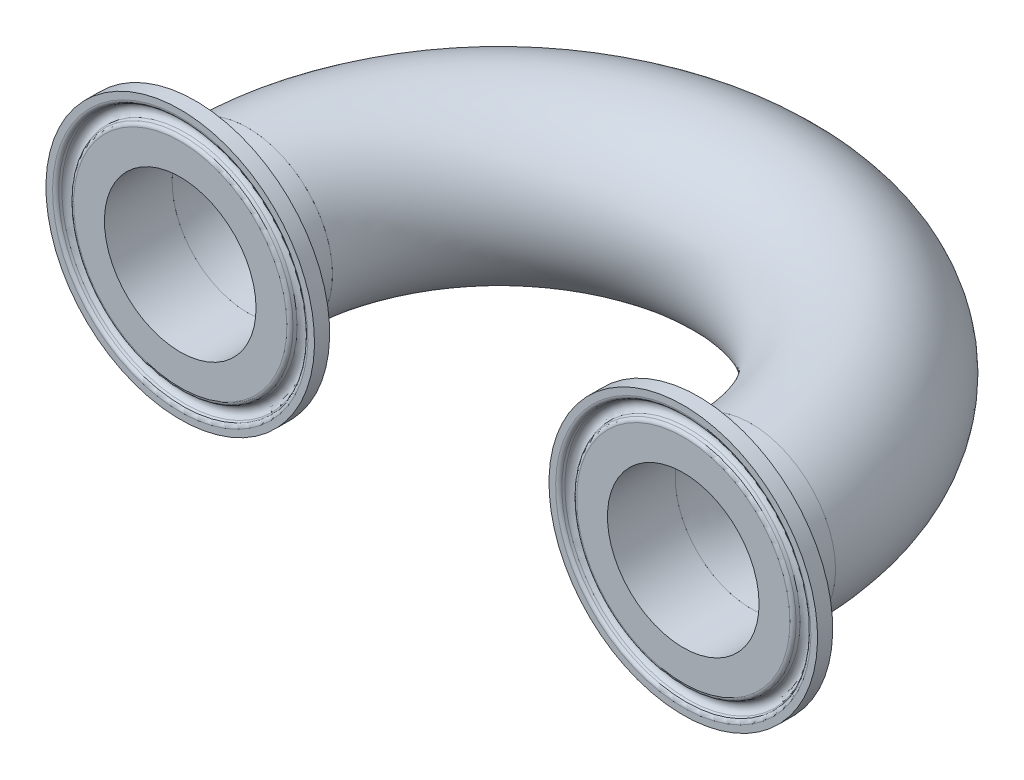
ISO-10303-21;
HEADER;
FILE_DESCRIPTION(('STEP AP214'),'2;1');
FILE_NAME('part.step','',(''),(''),'','','');
FILE_SCHEMA(('AUTOMOTIVE_DESIGN { 1 0 10303 214 1 1 1 1 }'));
ENDSEC;
DATA;
#1=APPLICATION_CONTEXT('core data for automotive mechanical design processes');
#2=APPLICATION_PROTOCOL_DEFINITION('international standard','automotive_design',2000,#1);
#3=PRODUCT_CONTEXT('',#1,'mechanical');
#4=PRODUCT('Part','Part','',(#3));
#5=PRODUCT_RELATED_PRODUCT_CATEGORY('part','',(#4));
#6=PRODUCT_DEFINITION_FORMATION('','',#4);
#7=PRODUCT_DEFINITION_CONTEXT('part definition',#1,'design');
#8=PRODUCT_DEFINITION('design','',#6,#7);
#9=PRODUCT_DEFINITION_SHAPE('','',#8);
#10=(LENGTH_UNIT() NAMED_UNIT(*) SI_UNIT(.MILLI.,.METRE.));
#11=(NAMED_UNIT(*) PLANE_ANGLE_UNIT() SI_UNIT($,.RADIAN.));
#12=(NAMED_UNIT(*) SI_UNIT($,.STERADIAN.) SOLID_ANGLE_UNIT());
#13=UNCERTAINTY_MEASURE_WITH_UNIT(LENGTH_MEASURE(1.E-05),#10,'distance_accuracy_value','');
#14=(GEOMETRIC_REPRESENTATION_CONTEXT(3) GLOBAL_UNCERTAINTY_ASSIGNED_CONTEXT((#13)) GLOBAL_UNIT_ASSIGNED_CONTEXT((#10,
#11,#12)) REPRESENTATION_CONTEXT('',''));
#15=CARTESIAN_POINT('',(0.,0.,0.));
#16=DIRECTION('',(0.,0.,1.));
#17=DIRECTION('',(1.,0.,0.));
#18=AXIS2_PLACEMENT_3D('',#15,#16,#17);
#19=CARTESIAN_POINT('',(-8.52017887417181,61.44684310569,79.1593916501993));
#20=DIRECTION('',(0.,0.,-1.));
#21=DIRECTION('',(-1.,0.,0.));
#22=AXIS2_PLACEMENT_3D('',#19,#20,#21);
#23=CIRCLE('',#22,15.875);
#24=CARTESIAN_POINT('',(39.1029132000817,61.44684310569,79.5856853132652));
#25=DIRECTION('',(0.,-1.,0.));
#26=AXIS1_PLACEMENT('',#24,#25);
#27=SURFACE_OF_REVOLUTION('',#23,#26);
#28=CARTESIAN_POINT('',(-24.3951788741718,61.44684310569,79.1593916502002));
#29=VERTEX_POINT('',#28);
#30=EDGE_CURVE('P0_E10',#29,#29,#23,.T.);
#31=ORIENTED_EDGE('',*,*,#30,.T.);
#32=EDGE_LOOP('',(#31));
#33=FACE_BOUND('',#32,.T.);
#34=CARTESIAN_POINT('',(86.7260052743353,61.44684310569,80.0119789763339));
#35=DIRECTION('',(0.,0.,1.));
#36=DIRECTION('',(1.,0.,0.));
#37=AXIS2_PLACEMENT_3D('',#34,#35,#36);
#38=CIRCLE('',#37,15.875);
#39=CARTESIAN_POINT('',(102.601005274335,61.44684310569,80.0119789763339));
#40=VERTEX_POINT('',#39);
#41=EDGE_CURVE('P0_E22',#40,#40,#38,.T.);
#42=ORIENTED_EDGE('',*,*,#41,.F.);
#43=EDGE_LOOP('',(#42));
#44=FACE_BOUND('',#43,.T.);
#45=ADVANCED_FACE('P0_F15',(#33,#44),#27,.F.);
#46=CARTESIAN_POINT('',(-8.52017887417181,61.44684310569,79.1593916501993));
#47=DIRECTION('',(0.,0.,-1.));
#48=DIRECTION('',(-1.,0.,0.));
#49=AXIS2_PLACEMENT_3D('',#46,#47,#48);
#50=PLANE('',#49);
#51=CARTESIAN_POINT('',(5.70367965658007,61.44684310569,79.1593916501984));
#52=CARTESIAN_POINT('',(5.70368252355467,61.0472105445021,79.1593916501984));
#53=CARTESIAN_POINT('',(5.68683115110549,60.6476250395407,79.1593916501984));
#54=CARTESIAN_POINT('',(5.61954327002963,59.8511607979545,79.1593916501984));
#55=CARTESIAN_POINT('',(5.56909792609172,59.4542828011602,79.1593916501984));
#56=CARTESIAN_POINT('',(5.43489579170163,58.6657660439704,79.1593916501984));
#57=CARTESIAN_POINT('',(5.35110319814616,58.2741333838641,79.1593916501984));
#58=CARTESIAN_POINT('',(5.15080475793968,57.499324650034,79.1593916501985));
#59=CARTESIAN_POINT('',(5.03429902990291,57.116148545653,79.1593916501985));
#60=CARTESIAN_POINT('',(4.76946724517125,56.3611639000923,79.1593916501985));
#61=CARTESIAN_POINT('',(4.62115660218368,55.9893499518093,79.1593916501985));
#62=CARTESIAN_POINT('',(4.29373368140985,55.2595336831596,79.1593916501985));
#63=CARTESIAN_POINT('',(4.11462091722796,54.9015315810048,79.1593916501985));
#64=CARTESIAN_POINT('',(3.72691846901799,54.2019806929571,79.1593916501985));
#65=CARTESIAN_POINT('',(3.51833631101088,53.8604277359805,79.1593916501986));
#66=CARTESIAN_POINT('',(3.07314398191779,53.1961065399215,79.1593916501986));
#67=CARTESIAN_POINT('',(2.83653392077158,52.8733382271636,79.1593916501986));
#68=CARTESIAN_POINT('',(2.33694314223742,52.2488495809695,79.1593916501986));
#69=CARTESIAN_POINT('',(2.07395992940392,51.947131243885,79.1593916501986));
#70=CARTESIAN_POINT('',(1.52351080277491,51.366920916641,79.1593916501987));
#71=CARTESIAN_POINT('',(1.23604486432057,51.0884289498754,79.1593916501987));
#72=CARTESIAN_POINT('',(0.63866251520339,50.5566412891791,79.1593916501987));
#73=CARTESIAN_POINT('',(0.328745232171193,50.3033465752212,79.1593916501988));
#74=CARTESIAN_POINT('',(-0.311326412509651,49.823766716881,79.1593916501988));
#75=CARTESIAN_POINT('',(-0.641480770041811,49.5974815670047,79.1593916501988));
#76=CARTESIAN_POINT('',(-1.3196683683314,49.1735364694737,79.1593916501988));
#77=CARTESIAN_POINT('',(-1.66770103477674,48.9758756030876,79.1593916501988));
#78=CARTESIAN_POINT('',(-2.37918068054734,48.6105756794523,79.1593916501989));
#79=CARTESIAN_POINT('',(-2.74262766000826,48.4429366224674,79.1593916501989));
#80=CARTESIAN_POINT('',(-3.48235125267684,48.1388724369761,79.159391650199));
#81=CARTESIAN_POINT('',(-3.85862783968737,48.0024472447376,79.159391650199));
#82=CARTESIAN_POINT('',(-4.62133623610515,47.7617802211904,79.159391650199));
#83=CARTESIAN_POINT('',(-5.00776804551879,47.657538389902,79.1593916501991));
#84=CARTESIAN_POINT('',(-5.7880395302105,47.4819791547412,79.1593916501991));
#85=CARTESIAN_POINT('',(-6.18187920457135,47.4106617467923,79.1593916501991));
#86=CARTESIAN_POINT('',(-6.97416650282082,47.3014583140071,79.1593916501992));
#87=CARTESIAN_POINT('',(-7.37261412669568,47.263572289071,79.1593916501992));
#88=CARTESIAN_POINT('',(-8.17128389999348,47.2215009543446,79.1593916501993));
#89=CARTESIAN_POINT('',(-8.57150604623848,47.217315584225,79.1593916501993));
#90=CARTESIAN_POINT('',(-9.37088027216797,47.2426751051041,79.1593916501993));
#91=CARTESIAN_POINT('',(-9.77003235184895,47.2722199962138,79.1593916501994));
#92=CARTESIAN_POINT('',(-10.56443081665,47.3648301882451,79.1593916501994));
#93=CARTESIAN_POINT('',(-10.9596771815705,47.4278956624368,79.1593916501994));
#94=CARTESIAN_POINT('',(-11.743452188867,47.5870987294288,79.1593916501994));
#95=CARTESIAN_POINT('',(-12.1319808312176,47.683236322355,79.1593916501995));
#96=CARTESIAN_POINT('',(-12.8995586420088,47.9079002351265,79.1593916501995));
#97=CARTESIAN_POINT('',(-13.2786078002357,48.0364265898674,79.1593916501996));
#98=CARTESIAN_POINT('',(-14.0245314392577,48.3249542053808,79.1593916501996));
#99=CARTESIAN_POINT('',(-14.3914059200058,48.4849554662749,79.1593916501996));
#100=CARTESIAN_POINT('',(-15.1103738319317,48.8352962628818,79.1593916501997));
#101=CARTESIAN_POINT('',(-15.4624671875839,49.0256359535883,79.1593916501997));
#102=CARTESIAN_POINT('',(-16.1493677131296,49.4352998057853,79.1593916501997));
#103=CARTESIAN_POINT('',(-16.4841748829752,49.6546239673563,79.1593916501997));
#104=CARTESIAN_POINT('',(-17.1341226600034,50.1206973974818,79.1593916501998));
#105=CARTESIAN_POINT('',(-17.4492632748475,50.3674466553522,79.1593916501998));
#106=CARTESIAN_POINT('',(-18.057637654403,50.886616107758,79.1593916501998));
#107=CARTESIAN_POINT('',(-18.3508714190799,51.1590363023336,79.1593916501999));
#108=CARTESIAN_POINT('',(-18.91334847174,51.7276119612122,79.1593916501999));
#109=CARTESIAN_POINT('',(-19.1825916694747,52.0237675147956,79.1593916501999));
#110=CARTESIAN_POINT('',(-19.6951722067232,52.637707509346,79.1593916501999));
#111=CARTESIAN_POINT('',(-19.9385095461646,52.9554919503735,79.1593916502));
#112=CARTESIAN_POINT('',(-20.397548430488,53.6104305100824,79.1593916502));
#113=CARTESIAN_POINT('',(-20.6132499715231,53.9475846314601,79.1593916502));
#114=CARTESIAN_POINT('',(-21.0154837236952,54.6388655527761,79.1593916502));
#115=CARTESIAN_POINT('',(-21.2020159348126,54.9929923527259,79.1593916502));
#116=CARTESIAN_POINT('',(-21.5445852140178,55.7157016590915,79.1593916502));
#117=CARTESIAN_POINT('',(-21.7006222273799,56.0842841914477,79.1593916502));
#118=CARTESIAN_POINT('',(-21.9810913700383,56.8332839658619,79.1593916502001));
#119=CARTESIAN_POINT('',(-22.1055234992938,57.2137012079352,79.1593916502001));
#120=CARTESIAN_POINT('',(-22.3218982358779,57.9836658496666,79.1593916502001));
#121=CARTESIAN_POINT('',(-22.4138408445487,58.3732132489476,79.1593916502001));
#122=CARTESIAN_POINT('',(-22.5645828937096,59.1586687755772,79.1593916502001));
#123=CARTESIAN_POINT('',(-22.6233823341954,59.5545769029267,79.1593916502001));
#124=CARTESIAN_POINT('',(-22.7074200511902,60.3499395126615,79.1593916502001));
#125=CARTESIAN_POINT('',(-22.7326583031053,60.7493939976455,79.1593916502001));
#126=CARTESIAN_POINT('',(-22.7493941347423,61.5490091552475,79.1593916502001));
#127=CARTESIAN_POINT('',(-22.740891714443,61.949169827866,79.1593916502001));
#128=CARTESIAN_POINT('',(-22.6902066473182,62.7473524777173,79.1593916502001));
#129=CARTESIAN_POINT('',(-22.6480239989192,63.1453744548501,79.1593916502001));
#130=CARTESIAN_POINT('',(-22.5302783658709,63.9364499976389,79.1593916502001));
#131=CARTESIAN_POINT('',(-22.4547153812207,64.3295035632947,79.1593916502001));
#132=CARTESIAN_POINT('',(-22.2707462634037,65.10784798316,79.1593916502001));
#133=CARTESIAN_POINT('',(-22.1623401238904,65.4931388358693,79.1593916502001));
#134=CARTESIAN_POINT('',(-21.9134554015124,66.2532185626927,79.1593916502));
#135=CARTESIAN_POINT('',(-21.7729768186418,66.6280074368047,79.1593916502));
#136=CARTESIAN_POINT('',(-21.4609459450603,67.3644186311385,79.1593916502));
#137=CARTESIAN_POINT('',(-21.289393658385,67.7260409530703,79.1593916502));
#138=CARTESIAN_POINT('',(-20.916434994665,68.4335481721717,79.1593916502));
#139=CARTESIAN_POINT('',(-20.715028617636,68.7794330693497,79.1593916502));
#140=CARTESIAN_POINT('',(-20.2837937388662,69.4530062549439,79.1593916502));
#141=CARTESIAN_POINT('',(-20.0539652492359,69.7806945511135,79.1593916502));
#142=CARTESIAN_POINT('',(-19.5675200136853,70.4155450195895,79.1593916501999));
#143=CARTESIAN_POINT('',(-19.3109032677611,70.7227071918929,79.1593916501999));
#144=CARTESIAN_POINT('',(-18.772705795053,71.314321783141,79.1593916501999));
#145=CARTESIAN_POINT('',(-18.4911250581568,71.5987741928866,79.1593916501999));
#146=CARTESIAN_POINT('',(-17.9050015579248,72.1429468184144,79.1593916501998));
#147=CARTESIAN_POINT('',(-17.6004587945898,72.4026670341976,79.1593916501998));
#148=CARTESIAN_POINT('',(-16.9705765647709,72.8955286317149,79.1593916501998));
#149=CARTESIAN_POINT('',(-16.6452371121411,73.1286700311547,79.1593916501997));
#150=CARTESIAN_POINT('',(-15.9760742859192,73.5667166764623,79.1593916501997));
#151=CARTESIAN_POINT('',(-15.6322509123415,73.7716219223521,79.1593916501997));
#152=CARTESIAN_POINT('',(-14.9285649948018,74.1517392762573,79.1593916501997));
#153=CARTESIAN_POINT('',(-14.5687024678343,74.3269514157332,79.1593916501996));
#154=CARTESIAN_POINT('',(-13.835496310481,74.6464371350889,79.1593916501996));
#155=CARTESIAN_POINT('',(-13.4621526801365,74.7907107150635,79.1593916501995));
#156=CARTESIAN_POINT('',(-12.7046395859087,75.04729323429,79.1593916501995));
#157=CARTESIAN_POINT('',(-12.3204701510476,75.159602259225,79.1593916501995));
#158=CARTESIAN_POINT('',(-11.5440357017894,75.3514576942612,79.1593916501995));
#159=CARTESIAN_POINT('',(-11.1517706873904,75.4310041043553,79.1593916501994));
#160=CARTESIAN_POINT('',(-10.3619331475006,75.5567688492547,79.1593916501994));
#161=CARTESIAN_POINT('',(-9.9643606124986,75.602987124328,79.1593916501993));
#162=CARTESIAN_POINT('',(-9.16673525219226,75.661766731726,79.1593916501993));
#163=CARTESIAN_POINT('',(-8.76668242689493,75.6743280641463,79.1593916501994));
#164=CARTESIAN_POINT('',(-7.96694312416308,75.6657044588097,79.1593916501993));
#165=CARTESIAN_POINT('',(-7.56725664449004,75.6445197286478,79.1593916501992));
#166=CARTESIAN_POINT('',(-6.77108911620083,75.5685549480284,79.1593916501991));
#167=CARTESIAN_POINT('',(-6.37460806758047,75.5137748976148,79.1593916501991));
#168=CARTESIAN_POINT('',(-5.58766938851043,75.3710087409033,79.1593916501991));
#169=CARTESIAN_POINT('',(-5.19721177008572,75.2830225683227,79.1593916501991));
#170=CARTESIAN_POINT('',(-4.42509674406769,75.0744696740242,79.159391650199));
#171=CARTESIAN_POINT('',(-4.04343933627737,74.9539029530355,79.159391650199));
#172=CARTESIAN_POINT('',(-3.29163329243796,74.6810443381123,79.159391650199));
#173=CARTESIAN_POINT('',(-2.92148480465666,74.5287520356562,79.1593916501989));
#174=CARTESIAN_POINT('',(-2.19533333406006,74.193525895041,79.1593916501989));
#175=CARTESIAN_POINT('',(-1.83933035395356,74.0105920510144,79.1593916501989));
#176=CARTESIAN_POINT('',(-1.14401462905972,73.6153911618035,79.1593916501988));
#177=CARTESIAN_POINT('',(-0.804701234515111,73.4031252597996,79.1593916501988));
#178=CARTESIAN_POINT('',(-0.145162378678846,72.9507641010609,79.1593916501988));
#179=CARTESIAN_POINT('',(0.175063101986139,72.7106688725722,79.1593916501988));
#180=CARTESIAN_POINT('',(0.794115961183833,72.2043836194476,79.1593916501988));
#181=CARTESIAN_POINT('',(1.0929456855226,71.938196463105,79.1593916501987));
#182=CARTESIAN_POINT('',(1.66712294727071,71.3815962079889,79.1593916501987));
#183=CARTESIAN_POINT('',(1.94247039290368,71.0911830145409,79.1593916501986));
#184=CARTESIAN_POINT('',(2.46779182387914,70.488118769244,79.1593916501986));
#185=CARTESIAN_POINT('',(2.71775932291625,70.175462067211,79.1593916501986));
#186=CARTESIAN_POINT('',(3.19045959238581,69.5302052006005,79.1593916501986));
#187=CARTESIAN_POINT('',(3.4131927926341,69.1976053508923,79.1593916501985));
#188=CARTESIAN_POINT('',(3.82994757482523,68.5146548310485,79.1593916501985));
#189=CARTESIAN_POINT('',(4.02395503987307,68.164295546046,79.1593916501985));
#190=CARTESIAN_POINT('',(4.38174758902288,67.4484710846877,79.1593916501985));
#191=CARTESIAN_POINT('',(4.5455325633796,67.0830058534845,79.1593916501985));
#192=CARTESIAN_POINT('',(4.84155518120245,66.3399636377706,79.1593916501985));
#193=CARTESIAN_POINT('',(4.97382655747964,65.9624000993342,79.1593916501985));
#194=CARTESIAN_POINT('',(5.2060756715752,65.1976023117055,79.1593916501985));
#195=CARTESIAN_POINT('',(5.30606189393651,64.8103706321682,79.1593916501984));
#196=CARTESIAN_POINT('',(5.49387686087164,63.9315058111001,79.1593916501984));
#197=CARTESIAN_POINT('',(5.57248615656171,63.4378754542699,79.1593916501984));
#198=CARTESIAN_POINT('',(5.67738576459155,62.4450866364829,79.1593916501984));
#199=CARTESIAN_POINT('',(5.70367607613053,61.9459281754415,79.1593916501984));
#200=CARTESIAN_POINT('',(5.70367965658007,61.44684310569,79.1593916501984));
#201=B_SPLINE_CURVE_WITH_KNOTS('',3,(#51,#52,#53,#54,#55,#56,#57,#58,#59,#60,#61,#62,#63,#64,
#65,#66,#67,#68,#69,#70,#71,#72,#73,#74,#75,#76,#77,#78,#79,#80,#81,#82,#83,#84,#85,#86,#87,#88,
#89,#90,#91,#92,#93,#94,#95,#96,#97,#98,#99,#100,#101,#102,#103,#104,#105,#106,#107,#108,#109,
#110,#111,#112,#113,#114,#115,#116,#117,#118,#119,#120,#121,#122,#123,#124,#125,#126,#127,#128,
#129,#130,#131,#132,#133,#134,#135,#136,#137,#138,#139,#140,#141,#142,#143,#144,#145,#146,#147,
#148,#149,#150,#151,#152,#153,#154,#155,#156,#157,#158,#159,#160,#161,#162,#163,#164,#165,#166,
#167,#168,#169,#170,#171,#172,#173,#174,#175,#176,#177,#178,#179,#180,#181,#182,#183,#184,#185,
#186,#187,#188,#189,#190,#191,#192,#193,#194,#195,#196,#197,#198,#199,#200),.UNSPECIFIED.,.T.,
.F.,(4,2,2,2,2,2,2,2,2,2,2,2,2,2,2,2,2,2,2,2,2,2,2,2,2,2,2,2,2,2,2,2,2,2,2,2,2,2,2,2,2,2,2,2,2,
2,2,2,2,2,2,2,2,2,2,2,2,2,2,2,2,2,2,2,2,2,2,2,2,2,2,2,2,2,4),(0.,1.19846174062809,
2.39723880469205,3.59730641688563,4.79736967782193,5.99685265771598,7.19635458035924,
8.39555072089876,9.59474215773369,10.7940471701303,11.9933533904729,13.1927062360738,
14.3920588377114,15.591372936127,16.7906870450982,17.9899987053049,19.1893103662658,
20.3886218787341,21.5879333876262,22.7872427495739,23.9865521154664,25.1858676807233,
26.3851832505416,27.5845001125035,28.783816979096,29.9831399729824,31.1824629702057,
32.3817855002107,33.5811080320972,34.7804350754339,35.9797621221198,37.1790893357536,
38.3784165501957,39.5777459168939,40.777075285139,41.9764046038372,43.1757339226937,
44.3750641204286,45.5743943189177,46.7737245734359,47.9730548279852,49.1723853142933,
50.3717158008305,51.5710461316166,52.7703764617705,53.9697062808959,55.169036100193,
56.3683664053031,57.5676967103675,58.7670262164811,59.9663557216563,61.165683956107,
62.3650121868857,63.5643372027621,64.7636622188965,65.9629893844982,67.1623165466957,
68.3616363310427,69.56095611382,70.7602782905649,71.9596004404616,73.1589380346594,
74.3582758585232,75.5575669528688,76.7568568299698,77.9560150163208,79.155177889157,
80.3546464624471,81.5540961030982,82.7541332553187,83.9541747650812,85.1529258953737,
86.3513617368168,87.8480724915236,89.3447832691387),.UNSPECIFIED.);
#202=CARTESIAN_POINT('',(5.70367965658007,61.44684310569,79.1593916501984));
#203=VERTEX_POINT('',#202);
#204=EDGE_CURVE('P0_E26',#203,#203,#201,.T.);
#205=ORIENTED_EDGE('',*,*,#204,.T.);
#206=EDGE_LOOP('',(#205));
#207=FACE_BOUND('',#206,.T.);
#208=ORIENTED_EDGE('',*,*,#30,.F.);
#209=EDGE_LOOP('',(#208));
#210=FACE_BOUND('',#209,.T.);
#211=ADVANCED_FACE('P0_F53',(#207,#210),#50,.F.);
#212=CARTESIAN_POINT('',(86.7260052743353,61.44684310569,80.0119789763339));
#213=DIRECTION('',(0.,0.,1.));
#214=DIRECTION('',(1.,0.,0.));
#215=AXIS2_PLACEMENT_3D('',#212,#213,#214);
#216=PLANE('',#215);
#217=CARTESIAN_POINT('',(72.5021467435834,61.44684310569,80.0119789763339));
#218=CARTESIAN_POINT('',(72.5021438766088,61.0472105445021,80.0119789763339));
#219=CARTESIAN_POINT('',(72.518995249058,60.6476250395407,80.0119789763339));
#220=CARTESIAN_POINT('',(72.5862831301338,59.8511607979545,80.0119789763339));
#221=CARTESIAN_POINT('',(72.6367284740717,59.4542828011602,80.0119789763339));
#222=CARTESIAN_POINT('',(72.7709306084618,58.6657660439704,80.0119789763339));
#223=CARTESIAN_POINT('',(72.8547232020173,58.2741333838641,80.0119789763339));
#224=CARTESIAN_POINT('',(73.0550216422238,57.499324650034,80.0119789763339));
#225=CARTESIAN_POINT('',(73.1715273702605,57.116148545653,80.011978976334));
#226=CARTESIAN_POINT('',(73.4363591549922,56.3611639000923,80.011978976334));
#227=CARTESIAN_POINT('',(73.5846697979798,55.9893499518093,80.0119789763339));
#228=CARTESIAN_POINT('',(73.9120927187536,55.2595336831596,80.0119789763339));
#229=CARTESIAN_POINT('',(74.0912054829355,54.9015315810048,80.0119789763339));
#230=CARTESIAN_POINT('',(74.4789079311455,54.2019806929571,80.0119789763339));
#231=CARTESIAN_POINT('',(74.6874900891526,53.8604277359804,80.0119789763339));
#232=CARTESIAN_POINT('',(75.1326824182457,53.1961065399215,80.0119789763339));
#233=CARTESIAN_POINT('',(75.3692924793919,52.8733382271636,80.0119789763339));
#234=CARTESIAN_POINT('',(75.868883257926,52.2488495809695,80.0119789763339));
#235=CARTESIAN_POINT('',(76.1318664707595,51.947131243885,80.0119789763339));
#236=CARTESIAN_POINT('',(76.6823155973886,51.366920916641,80.0119789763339));
#237=CARTESIAN_POINT('',(76.9697815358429,51.0884289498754,80.0119789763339));
#238=CARTESIAN_POINT('',(77.5671638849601,50.5566412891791,80.0119789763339));
#239=CARTESIAN_POINT('',(77.8770811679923,50.3033465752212,80.0119789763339));
#240=CARTESIAN_POINT('',(78.5171528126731,49.823766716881,80.0119789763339));
#241=CARTESIAN_POINT('',(78.8473071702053,49.5974815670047,80.011978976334));
#242=CARTESIAN_POINT('',(79.5254947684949,49.1735364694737,80.011978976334));
#243=CARTESIAN_POINT('',(79.8735274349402,48.9758756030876,80.0119789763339));
#244=CARTESIAN_POINT('',(80.5850070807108,48.6105756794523,80.0119789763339));
#245=CARTESIAN_POINT('',(80.9484540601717,48.4429366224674,80.0119789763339));
#246=CARTESIAN_POINT('',(81.6881776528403,48.1388724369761,80.0119789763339));
#247=CARTESIAN_POINT('',(82.0644542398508,48.0024472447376,80.0119789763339));
#248=CARTESIAN_POINT('',(82.8271626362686,47.7617802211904,80.0119789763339));
#249=CARTESIAN_POINT('',(83.2135944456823,47.657538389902,80.0119789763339));
#250=CARTESIAN_POINT('',(83.993865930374,47.4819791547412,80.0119789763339));
#251=CARTESIAN_POINT('',(84.3877056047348,47.4106617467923,80.0119789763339));
#252=CARTESIAN_POINT('',(85.1799929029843,47.301458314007,80.0119789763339));
#253=CARTESIAN_POINT('',(85.5784405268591,47.263572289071,80.0119789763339));
#254=CARTESIAN_POINT('',(86.377110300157,47.2215009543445,80.0119789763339));
#255=CARTESIAN_POINT('',(86.777332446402,47.217315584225,80.0119789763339));
#256=CARTESIAN_POINT('',(87.5767066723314,47.2426751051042,80.0119789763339));
#257=CARTESIAN_POINT('',(87.9758587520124,47.2722199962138,80.0119789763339));
#258=CARTESIAN_POINT('',(88.7702572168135,47.3648301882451,80.0119789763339));
#259=CARTESIAN_POINT('',(89.1655035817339,47.4278956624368,80.0119789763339));
#260=CARTESIAN_POINT('',(89.9492785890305,47.5870987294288,80.0119789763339));
#261=CARTESIAN_POINT('',(90.3378072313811,47.683236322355,80.0119789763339));
#262=CARTESIAN_POINT('',(91.1053850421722,47.9079002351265,80.0119789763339));
#263=CARTESIAN_POINT('',(91.4844342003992,48.0364265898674,80.011978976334));
#264=CARTESIAN_POINT('',(92.2303578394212,48.3249542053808,80.0119789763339));
#265=CARTESIAN_POINT('',(92.5972323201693,48.4849554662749,80.0119789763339));
#266=CARTESIAN_POINT('',(93.3162002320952,48.8352962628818,80.0119789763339));
#267=CARTESIAN_POINT('',(93.6682935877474,49.0256359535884,80.0119789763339));
#268=CARTESIAN_POINT('',(94.3551941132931,49.4352998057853,80.011978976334));
#269=CARTESIAN_POINT('',(94.6900012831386,49.6546239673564,80.0119789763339));
#270=CARTESIAN_POINT('',(95.3399490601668,50.1206973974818,80.0119789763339));
#271=CARTESIAN_POINT('',(95.655089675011,50.3674466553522,80.0119789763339));
#272=CARTESIAN_POINT('',(96.2634640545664,50.886616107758,80.0119789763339));
#273=CARTESIAN_POINT('',(96.5566978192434,51.1590363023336,80.0119789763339));
#274=CARTESIAN_POINT('',(97.1191748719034,51.7276119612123,80.0119789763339));
#275=CARTESIAN_POINT('',(97.3884180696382,52.0237675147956,80.0119789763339));
#276=CARTESIAN_POINT('',(97.9009986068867,52.637707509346,80.0119789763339));
#277=CARTESIAN_POINT('',(98.144335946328,52.9554919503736,80.0119789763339));
#278=CARTESIAN_POINT('',(98.6033748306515,53.6104305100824,80.0119789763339));
#279=CARTESIAN_POINT('',(98.8190763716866,53.9475846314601,80.0119789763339));
#280=CARTESIAN_POINT('',(99.2213101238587,54.6388655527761,80.0119789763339));
#281=CARTESIAN_POINT('',(99.4078423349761,54.9929923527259,80.011978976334));
#282=CARTESIAN_POINT('',(99.7504116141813,55.7157016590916,80.011978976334));
#283=CARTESIAN_POINT('',(99.9064486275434,56.0842841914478,80.0119789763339));
#284=CARTESIAN_POINT('',(100.186917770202,56.833283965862,80.0119789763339));
#285=CARTESIAN_POINT('',(100.311349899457,57.2137012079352,80.0119789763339));
#286=CARTESIAN_POINT('',(100.527724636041,57.9836658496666,80.0119789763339));
#287=CARTESIAN_POINT('',(100.619667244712,58.3732132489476,80.0119789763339));
#288=CARTESIAN_POINT('',(100.770409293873,59.1586687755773,80.0119789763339));
#289=CARTESIAN_POINT('',(100.829208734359,59.5545769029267,80.011978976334));
#290=CARTESIAN_POINT('',(100.913246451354,60.3499395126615,80.011978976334));
#291=CARTESIAN_POINT('',(100.938484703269,60.7493939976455,80.0119789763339));
#292=CARTESIAN_POINT('',(100.955220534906,61.5490091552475,80.0119789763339));
#293=CARTESIAN_POINT('',(100.946718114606,61.949169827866,80.0119789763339));
#294=CARTESIAN_POINT('',(100.896033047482,62.7473524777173,80.0119789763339));
#295=CARTESIAN_POINT('',(100.853850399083,63.1453744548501,80.0119789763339));
#296=CARTESIAN_POINT('',(100.736104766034,63.9364499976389,80.0119789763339));
#297=CARTESIAN_POINT('',(100.660541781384,64.3295035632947,80.0119789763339));
#298=CARTESIAN_POINT('',(100.476572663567,65.10784798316,80.0119789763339));
#299=CARTESIAN_POINT('',(100.368166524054,65.4931388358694,80.0119789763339));
#300=CARTESIAN_POINT('',(100.119281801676,66.2532185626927,80.0119789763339));
#301=CARTESIAN_POINT('',(99.9788032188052,66.6280074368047,80.0119789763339));
#302=CARTESIAN_POINT('',(99.6667723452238,67.3644186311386,80.0119789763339));
#303=CARTESIAN_POINT('',(99.4952200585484,67.7260409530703,80.0119789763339));
#304=CARTESIAN_POINT('',(99.1222613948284,68.4335481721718,80.0119789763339));
#305=CARTESIAN_POINT('',(98.9208550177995,68.7794330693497,80.011978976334));
#306=CARTESIAN_POINT('',(98.4896201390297,69.4530062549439,80.011978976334));
#307=CARTESIAN_POINT('',(98.2597916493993,69.7806945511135,80.0119789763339));
#308=CARTESIAN_POINT('',(97.7733464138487,70.4155450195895,80.0119789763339));
#309=CARTESIAN_POINT('',(97.5167296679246,70.7227071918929,80.0119789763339));
#310=CARTESIAN_POINT('',(96.9785321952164,71.314321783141,80.0119789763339));
#311=CARTESIAN_POINT('',(96.6969514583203,71.5987741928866,80.0119789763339));
#312=CARTESIAN_POINT('',(96.1108279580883,72.1429468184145,80.0119789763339));
#313=CARTESIAN_POINT('',(95.8062851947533,72.4026670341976,80.0119789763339));
#314=CARTESIAN_POINT('',(95.1764029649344,72.8955286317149,80.0119789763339));
#315=CARTESIAN_POINT('',(94.8510635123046,73.1286700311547,80.0119789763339));
#316=CARTESIAN_POINT('',(94.1819006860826,73.5667166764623,80.0119789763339));
#317=CARTESIAN_POINT('',(93.8380773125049,73.7716219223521,80.0119789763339));
#318=CARTESIAN_POINT('',(93.1343913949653,74.1517392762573,80.0119789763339));
#319=CARTESIAN_POINT('',(92.7745288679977,74.3269514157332,80.0119789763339));
#320=CARTESIAN_POINT('',(92.0413227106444,74.6464371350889,80.0119789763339));
#321=CARTESIAN_POINT('',(91.6679790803,74.7907107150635,80.0119789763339));
#322=CARTESIAN_POINT('',(90.9104659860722,75.04729323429,80.0119789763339));
#323=CARTESIAN_POINT('',(90.5262965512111,75.159602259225,80.0119789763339));
#324=CARTESIAN_POINT('',(89.7498621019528,75.3514576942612,80.0119789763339));
#325=CARTESIAN_POINT('',(89.3575970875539,75.4310041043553,80.0119789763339));
#326=CARTESIAN_POINT('',(88.567759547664,75.5567688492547,80.0119789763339));
#327=CARTESIAN_POINT('',(88.170187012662,75.602987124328,80.0119789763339));
#328=CARTESIAN_POINT('',(87.3725616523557,75.661766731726,80.0119789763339));
#329=CARTESIAN_POINT('',(86.9725088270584,75.6743280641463,80.0119789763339));
#330=CARTESIAN_POINT('',(86.1727695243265,75.6657044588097,80.0119789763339));
#331=CARTESIAN_POINT('',(85.7730830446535,75.6445197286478,80.0119789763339));
#332=CARTESIAN_POINT('',(84.9769155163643,75.5685549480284,80.0119789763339));
#333=CARTESIAN_POINT('',(84.5804344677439,75.5137748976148,80.0119789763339));
#334=CARTESIAN_POINT('',(83.7934957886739,75.3710087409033,80.0119789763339));
#335=CARTESIAN_POINT('',(83.4030381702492,75.2830225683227,80.0119789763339));
#336=CARTESIAN_POINT('',(82.6309231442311,75.0744696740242,80.0119789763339));
#337=CARTESIAN_POINT('',(82.2492657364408,74.9539029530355,80.011978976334));
#338=CARTESIAN_POINT('',(81.4974596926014,74.6810443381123,80.011978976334));
#339=CARTESIAN_POINT('',(81.1273112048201,74.5287520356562,80.0119789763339));
#340=CARTESIAN_POINT('',(80.4011597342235,74.193525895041,80.0119789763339));
#341=CARTESIAN_POINT('',(80.045156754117,74.0105920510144,80.0119789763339));
#342=CARTESIAN_POINT('',(79.3498410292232,73.6153911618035,80.0119789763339));
#343=CARTESIAN_POINT('',(79.0105276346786,73.4031252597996,80.0119789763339));
#344=CARTESIAN_POINT('',(78.3509887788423,72.9507641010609,80.0119789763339));
#345=CARTESIAN_POINT('',(78.0307632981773,72.7106688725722,80.0119789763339));
#346=CARTESIAN_POINT('',(77.4117104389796,72.2043836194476,80.0119789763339));
#347=CARTESIAN_POINT('',(77.1128807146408,71.938196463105,80.0119789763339));
#348=CARTESIAN_POINT('',(76.5387034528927,71.3815962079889,80.0119789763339));
#349=CARTESIAN_POINT('',(76.2633560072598,71.0911830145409,80.0119789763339));
#350=CARTESIAN_POINT('',(75.7380345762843,70.488118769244,80.0119789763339));
#351=CARTESIAN_POINT('',(75.4880670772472,70.175462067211,80.0119789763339));
#352=CARTESIAN_POINT('',(75.0153668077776,69.5302052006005,80.0119789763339));
#353=CARTESIAN_POINT('',(74.7926336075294,69.1976053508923,80.0119789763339));
#354=CARTESIAN_POINT('',(74.3758788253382,68.5146548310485,80.0119789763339));
#355=CARTESIAN_POINT('',(74.1818713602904,68.164295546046,80.0119789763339));
#356=CARTESIAN_POINT('',(73.8240788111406,67.4484710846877,80.0119789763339));
#357=CARTESIAN_POINT('',(73.6602938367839,67.0830058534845,80.0119789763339));
#358=CARTESIAN_POINT('',(73.364271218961,66.3399636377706,80.0119789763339));
#359=CARTESIAN_POINT('',(73.2319998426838,65.9624000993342,80.0119789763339));
#360=CARTESIAN_POINT('',(72.9997507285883,65.1976023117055,80.0119789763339));
#361=CARTESIAN_POINT('',(72.899764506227,64.8103706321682,80.0119789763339));
#362=CARTESIAN_POINT('',(72.7119495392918,63.9315058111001,80.0119789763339));
#363=CARTESIAN_POINT('',(72.6333402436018,63.4378754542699,80.0119789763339));
#364=CARTESIAN_POINT('',(72.5284406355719,62.4450866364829,80.0119789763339));
#365=CARTESIAN_POINT('',(72.5021503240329,61.9459281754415,80.0119789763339));
#366=CARTESIAN_POINT('',(72.5021467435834,61.44684310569,80.0119789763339));
#367=B_SPLINE_CURVE_WITH_KNOTS('',3,(#217,#218,#219,#220,#221,#222,#223,#224,#225,#226,#227,
#228,#229,#230,#231,#232,#233,#234,#235,#236,#237,#238,#239,#240,#241,#242,#243,#244,#245,#246,
#247,#248,#249,#250,#251,#252,#253,#254,#255,#256,#257,#258,#259,#260,#261,#262,#263,#264,#265,
#266,#267,#268,#269,#270,#271,#272,#273,#274,#275,#276,#277,#278,#279,#280,#281,#282,#283,#284,
#285,#286,#287,#288,#289,#290,#291,#292,#293,#294,#295,#296,#297,#298,#299,#300,#301,#302,#303,
#304,#305,#306,#307,#308,#309,#310,#311,#312,#313,#314,#315,#316,#317,#318,#319,#320,#321,#322,
#323,#324,#325,#326,#327,#328,#329,#330,#331,#332,#333,#334,#335,#336,#337,#338,#339,#340,#341,
#342,#343,#344,#345,#346,#347,#348,#349,#350,#351,#352,#353,#354,#355,#356,#357,#358,#359,#360,
#361,#362,#363,#364,#365,#366),.UNSPECIFIED.,.T.,.F.,(4,2,2,2,2,2,2,2,2,2,2,2,2,2,2,2,2,2,2,2,2,
2,2,2,2,2,2,2,2,2,2,2,2,2,2,2,2,2,2,2,2,2,2,2,2,2,2,2,2,2,2,2,2,2,2,2,2,2,2,2,2,2,2,2,2,2,2,2,2,
2,2,2,2,2,4),(0.,1.19846174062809,2.39723880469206,3.59730641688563,4.79736967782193,
5.99685265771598,7.19635458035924,8.39555072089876,9.59474215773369,10.7940471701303,
11.9933533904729,13.1927062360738,14.3920588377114,15.591372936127,16.7906870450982,
17.9899987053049,19.1893103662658,20.3886218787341,21.5879333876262,22.787242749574,
23.9865521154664,25.1858676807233,26.3851832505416,27.5845001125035,28.783816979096,
29.9831399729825,31.1824629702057,32.3817855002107,33.5811080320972,34.7804350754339,
35.9797621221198,37.1790893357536,38.3784165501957,39.5777459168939,40.777075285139,
41.9764046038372,43.1757339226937,44.3750641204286,45.5743943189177,46.7737245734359,
47.9730548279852,49.1723853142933,50.3717158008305,51.5710461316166,52.7703764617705,
53.9697062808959,55.169036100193,56.3683664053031,57.5676967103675,58.7670262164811,
59.9663557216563,61.165683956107,62.3650121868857,63.5643372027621,64.7636622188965,
65.9629893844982,67.1623165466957,68.3616363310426,69.5609561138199,70.7602782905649,
71.9596004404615,73.1589380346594,74.3582758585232,75.5575669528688,76.7568568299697,
77.9560150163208,79.155177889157,80.3546464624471,81.5540961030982,82.7541332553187,
83.9541747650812,85.1529258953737,86.3513617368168,87.8480724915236,89.3447832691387),.UNSPECIFIED.);
#368=CARTESIAN_POINT('',(72.5021467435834,61.44684310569,80.0119789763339));
#369=VERTEX_POINT('',#368);
#370=EDGE_CURVE('P0_E30',#369,#369,#367,.T.);
#371=ORIENTED_EDGE('',*,*,#370,.F.);
#372=EDGE_LOOP('',(#371));
#373=FACE_BOUND('',#372,.T.);
#374=ORIENTED_EDGE('',*,*,#41,.T.);
#375=EDGE_LOOP('',(#374));
#376=FACE_BOUND('',#375,.T.);
#377=ADVANCED_FACE('P0_F48',(#373,#376),#216,.T.);
#378=CARTESIAN_POINT('',(-8.52017887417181,61.44684310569,79.1593916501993));
#379=DIRECTION('',(0.,0.,-1.));
#380=DIRECTION('',(-1.,0.,0.));
#381=AXIS2_PLACEMENT_3D('',#378,#379,#380);
#382=CIRCLE('',#381,15.875);
#383=CARTESIAN_POINT('',(39.1029132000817,61.44684310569,79.5856853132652));
#384=DIRECTION('',(0.,-1.,0.));
#385=AXIS1_PLACEMENT('',#383,#384);
#386=SURFACE_OF_REVOLUTION('',#382,#385);
#387=OFFSET_SURFACE('',#386,1.651,.F.);
#388=ORIENTED_EDGE('',*,*,#204,.F.);
#389=EDGE_LOOP('',(#388));
#390=FACE_BOUND('',#389,.T.);
#391=ORIENTED_EDGE('',*,*,#370,.T.);
#392=EDGE_LOOP('',(#391));
#393=FACE_BOUND('',#392,.T.);
#394=ADVANCED_FACE('P0_F43',(#390,#393),#387,.T.);
#395=CLOSED_SHELL('',(#45,#211,#377,#394));
#396=MANIFOLD_SOLID_BREP('P0_B1',#395);
#397=CARTESIAN_POINT('',(-8.52017887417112,61.44684310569,90.875392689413));
#398=DIRECTION('',(0.,0.,-1.));
#399=DIRECTION('',(-0.940702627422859,0.339232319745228,0.));
#400=AXIS2_PLACEMENT_3D('',#397,#398,#399);
#401=CONICAL_SURFACE('',#400,20.9336326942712,0.401425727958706);
#402=CARTESIAN_POINT('',(-8.52017887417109,61.44684310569,91.3951287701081));
#403=DIRECTION('',(0.,0.,1.));
#404=DIRECTION('',(0.940702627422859,-0.339232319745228,0.));
#405=AXIS2_PLACEMENT_3D('',#402,#403,#404);
#406=CIRCLE('',#405,20.7130178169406);
#407=CARTESIAN_POINT('',(10.9646114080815,54.420318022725,91.3951287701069));
#408=VERTEX_POINT('',#407);
#409=EDGE_CURVE('P1_E10',#408,#408,#406,.T.);
#410=ORIENTED_EDGE('',*,*,#409,.F.);
#411=EDGE_LOOP('',(#410));
#412=FACE_BOUND('',#411,.T.);
#413=CARTESIAN_POINT('',(-8.52017887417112,61.44684310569,90.875392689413));
#414=DIRECTION('',(0.,0.,1.));
#415=DIRECTION('',(0.940702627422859,-0.339232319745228,0.));
#416=AXIS2_PLACEMENT_3D('',#413,#414,#415);
#417=CIRCLE('',#416,20.9336326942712);
#418=CARTESIAN_POINT('',(11.1721444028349,54.3454783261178,90.8753926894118));
#419=VERTEX_POINT('',#418);
#420=EDGE_CURVE('P1_E55',#419,#419,#417,.T.);
#421=ORIENTED_EDGE('',*,*,#420,.T.);
#422=EDGE_LOOP('',(#421));
#423=FACE_BOUND('',#422,.T.);
#424=ADVANCED_FACE('P1_F15',(#412,#423),#401,.T.);
#425=CARTESIAN_POINT('',(-8.5201788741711,61.44684310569,91.0973916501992));
#426=DIRECTION('',(0.,0.,1.));
#427=DIRECTION('',(0.940702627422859,-0.339232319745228,0.));
#428=AXIS2_PLACEMENT_3D('',#425,#426,#427);
#429=TOROIDAL_SURFACE('',#428,20.0115931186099,0.761999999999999);
#430=CARTESIAN_POINT('',(-8.52017887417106,61.44684310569,91.8593916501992));
#431=DIRECTION('',(0.,0.,1.));
#432=DIRECTION('',(0.940702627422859,-0.339232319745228,0.));
#433=AXIS2_PLACEMENT_3D('',#430,#431,#432);
#434=CIRCLE('',#433,20.0115931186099);
#435=CARTESIAN_POINT('',(10.3047793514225,54.6582639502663,91.8593916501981));
#436=VERTEX_POINT('',#435);
#437=EDGE_CURVE('P1_E21',#436,#436,#434,.T.);
#438=ORIENTED_EDGE('',*,*,#437,.F.);
#439=EDGE_LOOP('',(#438));
#440=FACE_BOUND('',#439,.T.);
#441=ORIENTED_EDGE('',*,*,#409,.T.);
#442=EDGE_LOOP('',(#441));
#443=FACE_BOUND('',#442,.T.);
#444=ADVANCED_FACE('P1_F85',(#440,#443),#429,.T.);
#445=CARTESIAN_POINT('',(-8.52017887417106,61.44684310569,91.8593916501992));
#446=DIRECTION('',(0.,0.,-1.));
#447=DIRECTION('',(-0.940702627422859,0.339232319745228,0.));
#448=AXIS2_PLACEMENT_3D('',#445,#446,#447);
#449=PLANE('',#448);
#450=CARTESIAN_POINT('',(-8.52017887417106,61.44684310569,91.8593916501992));
#451=DIRECTION('',(0.,0.,1.));
#452=DIRECTION('',(0.940702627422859,-0.339232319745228,0.));
#453=AXIS2_PLACEMENT_3D('',#450,#451,#452);
#454=CIRCLE('',#453,14.224);
#455=CARTESIAN_POINT('',(4.86037529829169,56.6216025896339,91.8593916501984));
#456=VERTEX_POINT('',#455);
#457=EDGE_CURVE('P1_E25',#456,#456,#454,.T.);
#458=ORIENTED_EDGE('',*,*,#457,.F.);
#459=EDGE_LOOP('',(#458));
#460=FACE_BOUND('',#459,.T.);
#461=ORIENTED_EDGE('',*,*,#437,.T.);
#462=EDGE_LOOP('',(#461));
#463=FACE_BOUND('',#462,.T.);
#464=ADVANCED_FACE('P1_F90',(#460,#463),#449,.F.);
#465=CARTESIAN_POINT('',(-8.52017887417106,61.44684310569,91.8593916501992));
#466=DIRECTION('',(0.,0.,1.));
#467=DIRECTION('',(0.940702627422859,-0.339232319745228,0.));
#468=AXIS2_PLACEMENT_3D('',#465,#466,#467);
#469=CYLINDRICAL_SURFACE('',#468,14.224);
#470=ORIENTED_EDGE('',*,*,#457,.T.);
#471=EDGE_LOOP('',(#470));
#472=FACE_BOUND('',#471,.T.);
#473=CARTESIAN_POINT('',(-8.52017887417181,61.44684310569,79.1593916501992));
#474=DIRECTION('',(0.,0.,1.));
#475=DIRECTION('',(0.940702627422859,-0.339232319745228,0.));
#476=AXIS2_PLACEMENT_3D('',#473,#474,#475);
#477=CIRCLE('',#476,14.224);
#478=CARTESIAN_POINT('',(4.86037529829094,56.6216025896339,79.1593916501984));
#479=VERTEX_POINT('',#478);
#480=EDGE_CURVE('P1_E29',#479,#479,#477,.T.);
#481=ORIENTED_EDGE('',*,*,#480,.F.);
#482=EDGE_LOOP('',(#481));
#483=FACE_BOUND('',#482,.T.);
#484=ADVANCED_FACE('P1_F95',(#472,#483),#469,.F.);
#485=CARTESIAN_POINT('',(-8.52017887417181,61.44684310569,79.1593916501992));
#486=DIRECTION('',(0.,0.,1.));
#487=DIRECTION('',(0.940702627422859,-0.339232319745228,0.));
#488=AXIS2_PLACEMENT_3D('',#485,#486,#487);
#489=PLANE('',#488);
#490=CARTESIAN_POINT('',(-8.52017887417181,61.44684310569,79.1593916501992));
#491=DIRECTION('',(0.,0.,1.));
#492=DIRECTION('',(0.940702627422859,-0.339232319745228,0.));
#493=AXIS2_PLACEMENT_3D('',#490,#491,#492);
#494=CIRCLE('',#493,15.875);
#495=CARTESIAN_POINT('',(6.41347533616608,56.0615300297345,79.1593916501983));
#496=VERTEX_POINT('',#495);
#497=EDGE_CURVE('P1_E34',#496,#496,#494,.T.);
#498=ORIENTED_EDGE('',*,*,#497,.F.);
#499=EDGE_LOOP('',(#498));
#500=FACE_BOUND('',#499,.T.);
#501=ORIENTED_EDGE('',*,*,#480,.T.);
#502=EDGE_LOOP('',(#501));
#503=FACE_BOUND('',#502,.T.);
#504=ADVANCED_FACE('P1_F101',(#500,#503),#489,.F.);
#505=CARTESIAN_POINT('',(-8.52017887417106,61.44684310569,91.8593916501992));
#506=DIRECTION('',(0.,0.,1.));
#507=DIRECTION('',(0.940702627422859,-0.339232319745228,0.));
#508=AXIS2_PLACEMENT_3D('',#505,#506,#507);
#509=CYLINDRICAL_SURFACE('',#508,15.875);
#510=CARTESIAN_POINT('',(-8.52017887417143,61.44684310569,85.6217339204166));
#511=DIRECTION('',(0.,0.,1.));
#512=DIRECTION('',(0.940702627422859,-0.339232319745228,0.));
#513=AXIS2_PLACEMENT_3D('',#510,#511,#512);
#514=CIRCLE('',#513,15.875);
#515=CARTESIAN_POINT('',(6.41347533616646,56.0615300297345,85.6217339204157));
#516=VERTEX_POINT('',#515);
#517=EDGE_CURVE('P1_E37',#516,#516,#514,.T.);
#518=ORIENTED_EDGE('',*,*,#517,.F.);
#519=EDGE_LOOP('',(#518));
#520=FACE_BOUND('',#519,.T.);
#521=ORIENTED_EDGE('',*,*,#497,.T.);
#522=EDGE_LOOP('',(#521));
#523=FACE_BOUND('',#522,.T.);
#524=ADVANCED_FACE('P1_F105',(#520,#523),#509,.T.);
#525=CARTESIAN_POINT('',(-8.52017887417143,61.44684310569,85.6217339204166));
#526=DIRECTION('',(0.,0.,1.));
#527=DIRECTION('',(0.940702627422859,-0.339232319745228,0.));
#528=AXIS2_PLACEMENT_3D('',#525,#526,#527);
#529=CONICAL_SURFACE('',#528,15.875,1.22173047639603);
#530=CARTESIAN_POINT('',(-8.52017887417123,61.44684310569,89.0145916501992));
#531=DIRECTION('',(0.,0.,1.));
#532=DIRECTION('',(0.940702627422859,-0.339232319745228,0.));
#533=AXIS2_PLACEMENT_3D('',#530,#531,#532);
#534=CIRCLE('',#533,25.1968);
#535=CARTESIAN_POINT('',(15.1825170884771,52.8992741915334,89.0145916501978));
#536=VERTEX_POINT('',#535);
#537=EDGE_CURVE('P1_E40',#536,#536,#534,.T.);
#538=ORIENTED_EDGE('',*,*,#537,.F.);
#539=EDGE_LOOP('',(#538));
#540=FACE_BOUND('',#539,.T.);
#541=ORIENTED_EDGE('',*,*,#517,.T.);
#542=EDGE_LOOP('',(#541));
#543=FACE_BOUND('',#542,.T.);
#544=ADVANCED_FACE('P1_F109',(#540,#543),#529,.T.);
#545=CARTESIAN_POINT('',(-8.52017887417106,61.44684310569,91.8593916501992));
#546=DIRECTION('',(0.,0.,1.));
#547=DIRECTION('',(0.940702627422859,-0.339232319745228,0.));
#548=AXIS2_PLACEMENT_3D('',#545,#546,#547);
#549=CYLINDRICAL_SURFACE('',#548,25.1968);
#550=CARTESIAN_POINT('',(-8.52017887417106,61.44684310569,91.8593916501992));
#551=DIRECTION('',(0.,0.,1.));
#552=DIRECTION('',(0.940702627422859,-0.339232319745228,0.));
#553=AXIS2_PLACEMENT_3D('',#550,#551,#552);
#554=CIRCLE('',#553,25.1968);
#555=CARTESIAN_POINT('',(15.1825170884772,52.8992741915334,91.8593916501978));
#556=VERTEX_POINT('',#555);
#557=EDGE_CURVE('P1_E43',#556,#556,#554,.T.);
#558=ORIENTED_EDGE('',*,*,#557,.F.);
#559=EDGE_LOOP('',(#558));
#560=FACE_BOUND('',#559,.T.);
#561=ORIENTED_EDGE('',*,*,#537,.T.);
#562=EDGE_LOOP('',(#561));
#563=FACE_BOUND('',#562,.T.);
#564=ADVANCED_FACE('P1_F81',(#560,#563),#549,.T.);
#565=CARTESIAN_POINT('',(-8.52017887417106,61.44684310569,91.8593916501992));
#566=DIRECTION('',(0.,0.,-1.));
#567=DIRECTION('',(-0.940702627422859,0.339232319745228,0.));
#568=AXIS2_PLACEMENT_3D('',#565,#566,#567);
#569=PLANE('',#568);
#570=CARTESIAN_POINT('',(-8.52017887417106,61.44684310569,91.8593916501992));
#571=DIRECTION('',(0.,0.,1.));
#572=DIRECTION('',(0.940702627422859,-0.339232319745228,0.));
#573=AXIS2_PLACEMENT_3D('',#570,#571,#572);
#574=CIRCLE('',#573,23.9521599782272);
#575=CARTESIAN_POINT('',(14.0116809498,53.3214963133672,91.8593916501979));
#576=VERTEX_POINT('',#575);
#577=EDGE_CURVE('P1_E46',#576,#576,#574,.T.);
#578=ORIENTED_EDGE('',*,*,#577,.F.);
#579=EDGE_LOOP('',(#578));
#580=FACE_BOUND('',#579,.T.);
#581=ORIENTED_EDGE('',*,*,#557,.T.);
#582=EDGE_LOOP('',(#581));
#583=FACE_BOUND('',#582,.T.);
#584=ADVANCED_FACE('P1_F74',(#580,#583),#569,.F.);
#585=CARTESIAN_POINT('',(-8.5201788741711,61.44684310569,91.0973916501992));
#586=DIRECTION('',(0.,0.,1.));
#587=DIRECTION('',(0.940702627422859,-0.339232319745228,0.));
#588=AXIS2_PLACEMENT_3D('',#585,#586,#587);
#589=TOROIDAL_SURFACE('',#588,23.9521599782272,0.761999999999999);
#590=ORIENTED_EDGE('',*,*,#577,.T.);
#591=EDGE_LOOP('',(#590));
#592=FACE_BOUND('',#591,.T.);
#593=CARTESIAN_POINT('',(-8.52017887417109,61.44684310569,91.3951287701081));
#594=DIRECTION('',(0.,0.,1.));
#595=DIRECTION('',(0.940702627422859,-0.339232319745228,0.));
#596=AXIS2_PLACEMENT_3D('',#593,#594,#595);
#597=CIRCLE('',#596,23.2507352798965);
#598=CARTESIAN_POINT('',(13.3518488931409,53.5594422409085,91.3951287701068));
#599=VERTEX_POINT('',#598);
#600=EDGE_CURVE('P1_E49',#599,#599,#597,.T.);
#601=ORIENTED_EDGE('',*,*,#600,.F.);
#602=EDGE_LOOP('',(#601));
#603=FACE_BOUND('',#602,.T.);
#604=ADVANCED_FACE('P1_F69',(#592,#603),#589,.T.);
#605=CARTESIAN_POINT('',(-8.52017887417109,61.44684310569,91.3951287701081));
#606=DIRECTION('',(0.,0.,1.));
#607=DIRECTION('',(0.940702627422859,-0.339232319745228,0.));
#608=AXIS2_PLACEMENT_3D('',#605,#606,#607);
#609=CONICAL_SURFACE('',#608,23.2507352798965,0.401425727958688);
#610=CARTESIAN_POINT('',(-8.52017887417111,61.44684310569,90.9865368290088));
#611=DIRECTION('',(0.,0.,1.));
#612=DIRECTION('',(0.940702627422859,-0.339232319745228,0.));
#613=AXIS2_PLACEMENT_3D('',#610,#611,#612);
#614=CIRCLE('',#613,23.0772982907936);
#615=CARTESIAN_POINT('',(13.1886962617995,53.6182776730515,90.9865368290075));
#616=VERTEX_POINT('',#615);
#617=EDGE_CURVE('P1_E52',#616,#616,#614,.T.);
#618=ORIENTED_EDGE('',*,*,#617,.F.);
#619=EDGE_LOOP('',(#618));
#620=FACE_BOUND('',#619,.T.);
#621=ORIENTED_EDGE('',*,*,#600,.T.);
#622=EDGE_LOOP('',(#621));
#623=FACE_BOUND('',#622,.T.);
#624=ADVANCED_FACE('P1_F63',(#620,#623),#609,.F.);
#625=CARTESIAN_POINT('',(-8.52017887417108,61.44684310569,91.4529916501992));
#626=DIRECTION('',(0.,0.,1.));
#627=DIRECTION('',(0.940702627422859,-0.339232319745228,0.));
#628=AXIS2_PLACEMENT_3D('',#625,#626,#627);
#629=TOROIDAL_SURFACE('',#628,21.9783995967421,1.1938);
#630=ORIENTED_EDGE('',*,*,#420,.F.);
#631=EDGE_LOOP('',(#630));
#632=FACE_BOUND('',#631,.T.);
#633=ORIENTED_EDGE('',*,*,#617,.T.);
#634=EDGE_LOOP('',(#633));
#635=FACE_BOUND('',#634,.T.);
#636=ADVANCED_FACE('P1_F60',(#632,#635),#629,.F.);
#637=CLOSED_SHELL('',(#424,#444,#464,#484,#504,#524,#544,#564,#584,#604,#624,#636));
#638=MANIFOLD_SOLID_BREP('P1_B1',#637);
#639=CARTESIAN_POINT('',(86.7260052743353,61.44684310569,91.7279800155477));
#640=DIRECTION('',(0.,0.,-1.));
#641=DIRECTION('',(-0.970952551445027,0.239272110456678,0.));
#642=AXIS2_PLACEMENT_3D('',#639,#640,#641);
#643=CONICAL_SURFACE('',#642,20.9336326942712,0.401425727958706);
#644=CARTESIAN_POINT('',(86.7260052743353,61.44684310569,92.2477160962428));
#645=DIRECTION('',(0.,0.,1.));
#646=DIRECTION('',(0.970952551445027,-0.239272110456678,0.));
#647=AXIS2_PLACEMENT_3D('',#644,#645,#646);
#648=CIRCLE('',#647,20.7130178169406);
#649=CARTESIAN_POINT('',(106.83736277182,56.4907956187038,92.2477160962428));
#650=VERTEX_POINT('',#649);
#651=EDGE_CURVE('P2_E9',#650,#650,#648,.T.);
#652=ORIENTED_EDGE('',*,*,#651,.F.);
#653=EDGE_LOOP('',(#652));
#654=FACE_BOUND('',#653,.T.);
#655=CARTESIAN_POINT('',(86.7260052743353,61.44684310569,91.7279800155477));
#656=DIRECTION('',(0.,0.,1.));
#657=DIRECTION('',(0.970952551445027,-0.239272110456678,0.));
#658=AXIS2_PLACEMENT_3D('',#655,#656,#657);
#659=CIRCLE('',#658,20.9336326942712);
#660=CARTESIAN_POINT('',(107.051569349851,56.4380086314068,91.7279800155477));
#661=VERTEX_POINT('',#660);
#662=EDGE_CURVE('P2_E54',#661,#661,#659,.T.);
#663=ORIENTED_EDGE('',*,*,#662,.T.);
#664=EDGE_LOOP('',(#663));
#665=FACE_BOUND('',#664,.T.);
#666=ADVANCED_FACE('P2_F14',(#654,#665),#643,.T.);
#667=CARTESIAN_POINT('',(86.7260052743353,61.44684310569,91.949978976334));
#668=DIRECTION('',(0.,0.,1.));
#669=DIRECTION('',(0.970952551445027,-0.239272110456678,0.));
#670=AXIS2_PLACEMENT_3D('',#667,#668,#669);
#671=TOROIDAL_SURFACE('',#670,20.0115931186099,0.761999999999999);
#672=CARTESIAN_POINT('',(86.7260052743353,61.44684310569,92.7119789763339));
#673=DIRECTION('',(0.,0.,1.));
#674=DIRECTION('',(0.970952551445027,-0.239272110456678,0.));
#675=AXIS2_PLACEMENT_3D('',#672,#673,#674);
#676=CIRCLE('',#675,20.0115931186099);
#677=CARTESIAN_POINT('',(106.156312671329,56.6586269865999,92.7119789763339));
#678=VERTEX_POINT('',#677);
#679=EDGE_CURVE('P2_E20',#678,#678,#676,.T.);
#680=ORIENTED_EDGE('',*,*,#679,.F.);
#681=EDGE_LOOP('',(#680));
#682=FACE_BOUND('',#681,.T.);
#683=ORIENTED_EDGE('',*,*,#651,.T.);
#684=EDGE_LOOP('',(#683));
#685=FACE_BOUND('',#684,.T.);
#686=ADVANCED_FACE('P2_F84',(#682,#685),#671,.T.);
#687=CARTESIAN_POINT('',(86.7260052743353,61.44684310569,92.7119789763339));
#688=DIRECTION('',(0.,0.,-1.));
#689=DIRECTION('',(-0.970952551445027,0.239272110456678,0.));
#690=AXIS2_PLACEMENT_3D('',#687,#688,#689);
#691=PLANE('',#690);
#692=CARTESIAN_POINT('',(86.7260052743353,61.44684310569,92.7119789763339));
#693=DIRECTION('',(0.,0.,1.));
#694=DIRECTION('',(0.970952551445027,-0.239272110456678,0.));
#695=AXIS2_PLACEMENT_3D('',#692,#693,#694);
#696=CIRCLE('',#695,14.224);
#697=CARTESIAN_POINT('',(100.536834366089,58.0434366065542,92.7119789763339));
#698=VERTEX_POINT('',#697);
#699=EDGE_CURVE('P2_E24',#698,#698,#696,.T.);
#700=ORIENTED_EDGE('',*,*,#699,.F.);
#701=EDGE_LOOP('',(#700));
#702=FACE_BOUND('',#701,.T.);
#703=ORIENTED_EDGE('',*,*,#679,.T.);
#704=EDGE_LOOP('',(#703));
#705=FACE_BOUND('',#704,.T.);
#706=ADVANCED_FACE('P2_F89',(#702,#705),#691,.F.);
#707=CARTESIAN_POINT('',(86.7260052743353,61.44684310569,92.7119789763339));
#708=DIRECTION('',(0.,0.,1.));
#709=DIRECTION('',(0.970952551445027,-0.239272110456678,0.));
#710=AXIS2_PLACEMENT_3D('',#707,#708,#709);
#711=CYLINDRICAL_SURFACE('',#710,14.224);
#712=ORIENTED_EDGE('',*,*,#699,.T.);
#713=EDGE_LOOP('',(#712));
#714=FACE_BOUND('',#713,.T.);
#715=CARTESIAN_POINT('',(86.7260052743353,61.44684310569,80.0119789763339));
#716=DIRECTION('',(0.,0.,1.));
#717=DIRECTION('',(0.970952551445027,-0.239272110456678,0.));
#718=AXIS2_PLACEMENT_3D('',#715,#716,#717);
#719=CIRCLE('',#718,14.224);
#720=CARTESIAN_POINT('',(100.536834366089,58.0434366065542,80.0119789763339));
#721=VERTEX_POINT('',#720);
#722=EDGE_CURVE('P2_E28',#721,#721,#719,.T.);
#723=ORIENTED_EDGE('',*,*,#722,.F.);
#724=EDGE_LOOP('',(#723));
#725=FACE_BOUND('',#724,.T.);
#726=ADVANCED_FACE('P2_F94',(#714,#725),#711,.F.);
#727=CARTESIAN_POINT('',(86.7260052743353,61.44684310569,80.0119789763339));
#728=DIRECTION('',(0.,0.,1.));
#729=DIRECTION('',(0.970952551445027,-0.239272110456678,0.));
#730=AXIS2_PLACEMENT_3D('',#727,#728,#729);
#731=PLANE('',#730);
#732=CARTESIAN_POINT('',(86.7260052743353,61.44684310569,80.0119789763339));
#733=DIRECTION('',(0.,0.,1.));
#734=DIRECTION('',(0.970952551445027,-0.239272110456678,0.));
#735=AXIS2_PLACEMENT_3D('',#732,#733,#734);
#736=CIRCLE('',#735,15.875);
#737=CARTESIAN_POINT('',(102.139877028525,57.6483983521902,80.0119789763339));
#738=VERTEX_POINT('',#737);
#739=EDGE_CURVE('P2_E33',#738,#738,#736,.T.);
#740=ORIENTED_EDGE('',*,*,#739,.F.);
#741=EDGE_LOOP('',(#740));
#742=FACE_BOUND('',#741,.T.);
#743=ORIENTED_EDGE('',*,*,#722,.T.);
#744=EDGE_LOOP('',(#743));
#745=FACE_BOUND('',#744,.T.);
#746=ADVANCED_FACE('P2_F100',(#742,#745),#731,.F.);
#747=CARTESIAN_POINT('',(86.7260052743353,61.44684310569,92.7119789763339));
#748=DIRECTION('',(0.,0.,1.));
#749=DIRECTION('',(0.970952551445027,-0.239272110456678,0.));
#750=AXIS2_PLACEMENT_3D('',#747,#748,#749);
#751=CYLINDRICAL_SURFACE('',#750,15.875);
#752=CARTESIAN_POINT('',(86.7260052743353,61.44684310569,86.4743212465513));
#753=DIRECTION('',(0.,0.,1.));
#754=DIRECTION('',(0.970952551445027,-0.239272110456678,0.));
#755=AXIS2_PLACEMENT_3D('',#752,#753,#754);
#756=CIRCLE('',#755,15.875);
#757=CARTESIAN_POINT('',(102.139877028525,57.6483983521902,86.4743212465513));
#758=VERTEX_POINT('',#757);
#759=EDGE_CURVE('P2_E36',#758,#758,#756,.T.);
#760=ORIENTED_EDGE('',*,*,#759,.F.);
#761=EDGE_LOOP('',(#760));
#762=FACE_BOUND('',#761,.T.);
#763=ORIENTED_EDGE('',*,*,#739,.T.);
#764=EDGE_LOOP('',(#763));
#765=FACE_BOUND('',#764,.T.);
#766=ADVANCED_FACE('P2_F104',(#762,#765),#751,.T.);
#767=CARTESIAN_POINT('',(86.7260052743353,61.44684310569,86.4743212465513));
#768=DIRECTION('',(0.,0.,1.));
#769=DIRECTION('',(0.970952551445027,-0.239272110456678,0.));
#770=AXIS2_PLACEMENT_3D('',#767,#768,#769);
#771=CONICAL_SURFACE('',#770,15.875,1.22173047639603);
#772=CARTESIAN_POINT('',(86.7260052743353,61.44684310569,89.8671789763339));
#773=DIRECTION('',(0.,0.,1.));
#774=DIRECTION('',(0.970952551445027,-0.239272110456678,0.));
#775=AXIS2_PLACEMENT_3D('',#772,#773,#774);
#776=CIRCLE('',#775,25.1968);
#777=CARTESIAN_POINT('',(111.190902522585,55.4179515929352,89.8671789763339));
#778=VERTEX_POINT('',#777);
#779=EDGE_CURVE('P2_E39',#778,#778,#776,.T.);
#780=ORIENTED_EDGE('',*,*,#779,.F.);
#781=EDGE_LOOP('',(#780));
#782=FACE_BOUND('',#781,.T.);
#783=ORIENTED_EDGE('',*,*,#759,.T.);
#784=EDGE_LOOP('',(#783));
#785=FACE_BOUND('',#784,.T.);
#786=ADVANCED_FACE('P2_F108',(#782,#785),#771,.T.);
#787=CARTESIAN_POINT('',(86.7260052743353,61.44684310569,92.7119789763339));
#788=DIRECTION('',(0.,0.,1.));
#789=DIRECTION('',(0.970952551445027,-0.239272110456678,0.));
#790=AXIS2_PLACEMENT_3D('',#787,#788,#789);
#791=CYLINDRICAL_SURFACE('',#790,25.1968);
#792=CARTESIAN_POINT('',(86.7260052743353,61.44684310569,92.7119789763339));
#793=DIRECTION('',(0.,0.,1.));
#794=DIRECTION('',(0.970952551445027,-0.239272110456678,0.));
#795=AXIS2_PLACEMENT_3D('',#792,#793,#794);
#796=CIRCLE('',#795,25.1968);
#797=CARTESIAN_POINT('',(111.190902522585,55.4179515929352,92.7119789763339));
#798=VERTEX_POINT('',#797);
#799=EDGE_CURVE('P2_E42',#798,#798,#796,.T.);
#800=ORIENTED_EDGE('',*,*,#799,.F.);
#801=EDGE_LOOP('',(#800));
#802=FACE_BOUND('',#801,.T.);
#803=ORIENTED_EDGE('',*,*,#779,.T.);
#804=EDGE_LOOP('',(#803));
#805=FACE_BOUND('',#804,.T.);
#806=ADVANCED_FACE('P2_F80',(#802,#805),#791,.T.);
#807=CARTESIAN_POINT('',(86.7260052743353,61.44684310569,92.7119789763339));
#808=DIRECTION('',(0.,0.,-1.));
#809=DIRECTION('',(-0.970952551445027,0.239272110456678,0.));
#810=AXIS2_PLACEMENT_3D('',#807,#808,#809);
#811=PLANE('',#810);
#812=CARTESIAN_POINT('',(86.7260052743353,61.44684310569,92.7119789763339));
#813=DIRECTION('',(0.,0.,1.));
#814=DIRECTION('',(0.970952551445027,-0.239272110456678,0.));
#815=AXIS2_PLACEMENT_3D('',#812,#813,#814);
#816=CIRCLE('',#815,23.9521599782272);
#817=CARTESIAN_POINT('',(109.982416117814,55.7157592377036,92.7119789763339));
#818=VERTEX_POINT('',#817);
#819=EDGE_CURVE('P2_E45',#818,#818,#816,.T.);
#820=ORIENTED_EDGE('',*,*,#819,.F.);
#821=EDGE_LOOP('',(#820));
#822=FACE_BOUND('',#821,.T.);
#823=ORIENTED_EDGE('',*,*,#799,.T.);
#824=EDGE_LOOP('',(#823));
#825=FACE_BOUND('',#824,.T.);
#826=ADVANCED_FACE('P2_F73',(#822,#825),#811,.F.);
#827=CARTESIAN_POINT('',(86.7260052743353,61.44684310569,91.949978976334));
#828=DIRECTION('',(0.,0.,1.));
#829=DIRECTION('',(0.970952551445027,-0.239272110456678,0.));
#830=AXIS2_PLACEMENT_3D('',#827,#828,#829);
#831=TOROIDAL_SURFACE('',#830,23.9521599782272,0.761999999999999);
#832=ORIENTED_EDGE('',*,*,#819,.T.);
#833=EDGE_LOOP('',(#832));
#834=FACE_BOUND('',#833,.T.);
#835=CARTESIAN_POINT('',(86.7260052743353,61.44684310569,92.2477160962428));
#836=DIRECTION('',(0.,0.,1.));
#837=DIRECTION('',(0.970952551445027,-0.239272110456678,0.));
#838=AXIS2_PLACEMENT_3D('',#835,#836,#837);
#839=CIRCLE('',#838,23.2507352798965);
#840=CARTESIAN_POINT('',(109.301366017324,55.8835906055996,92.2477160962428));
#841=VERTEX_POINT('',#840);
#842=EDGE_CURVE('P2_E48',#841,#841,#839,.T.);
#843=ORIENTED_EDGE('',*,*,#842,.F.);
#844=EDGE_LOOP('',(#843));
#845=FACE_BOUND('',#844,.T.);
#846=ADVANCED_FACE('P2_F68',(#834,#845),#831,.T.);
#847=CARTESIAN_POINT('',(86.7260052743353,61.44684310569,92.2477160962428));
#848=DIRECTION('',(0.,0.,1.));
#849=DIRECTION('',(0.970952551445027,-0.239272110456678,0.));
#850=AXIS2_PLACEMENT_3D('',#847,#848,#849);
#851=CONICAL_SURFACE('',#850,23.2507352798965,0.401425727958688);
#852=CARTESIAN_POINT('',(86.7260052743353,61.44684310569,91.8391241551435));
#853=DIRECTION('',(0.,0.,1.));
#854=DIRECTION('',(0.970952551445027,-0.239272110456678,0.));
#855=AXIS2_PLACEMENT_3D('',#852,#853,#854);
#856=CIRCLE('',#855,23.0772982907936);
#857=CARTESIAN_POINT('',(109.132966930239,55.9250892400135,91.8391241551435));
#858=VERTEX_POINT('',#857);
#859=EDGE_CURVE('P2_E51',#858,#858,#856,.T.);
#860=ORIENTED_EDGE('',*,*,#859,.F.);
#861=EDGE_LOOP('',(#860));
#862=FACE_BOUND('',#861,.T.);
#863=ORIENTED_EDGE('',*,*,#842,.T.);
#864=EDGE_LOOP('',(#863));
#865=FACE_BOUND('',#864,.T.);
#866=ADVANCED_FACE('P2_F62',(#862,#865),#851,.F.);
#867=CARTESIAN_POINT('',(86.7260052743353,61.44684310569,92.3055789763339));
#868=DIRECTION('',(0.,0.,1.));
#869=DIRECTION('',(0.970952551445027,-0.239272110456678,0.));
#870=AXIS2_PLACEMENT_3D('',#867,#868,#869);
#871=TOROIDAL_SURFACE('',#870,21.9783995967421,1.1938);
#872=ORIENTED_EDGE('',*,*,#662,.F.);
#873=EDGE_LOOP('',(#872));
#874=FACE_BOUND('',#873,.T.);
#875=ORIENTED_EDGE('',*,*,#859,.T.);
#876=EDGE_LOOP('',(#875));
#877=FACE_BOUND('',#876,.T.);
#878=ADVANCED_FACE('P2_F59',(#874,#877),#871,.F.);
#879=CLOSED_SHELL('',(#666,#686,#706,#726,#746,#766,#786,#806,#826,#846,#866,#878));
#880=MANIFOLD_SOLID_BREP('P2_B1',#879);
#881=ADVANCED_BREP_SHAPE_REPRESENTATION('',(#18,#396,#638,#880),#14);
#882=SHAPE_DEFINITION_REPRESENTATION(#9,#881);
ENDSEC;
END-ISO-10303-21;
